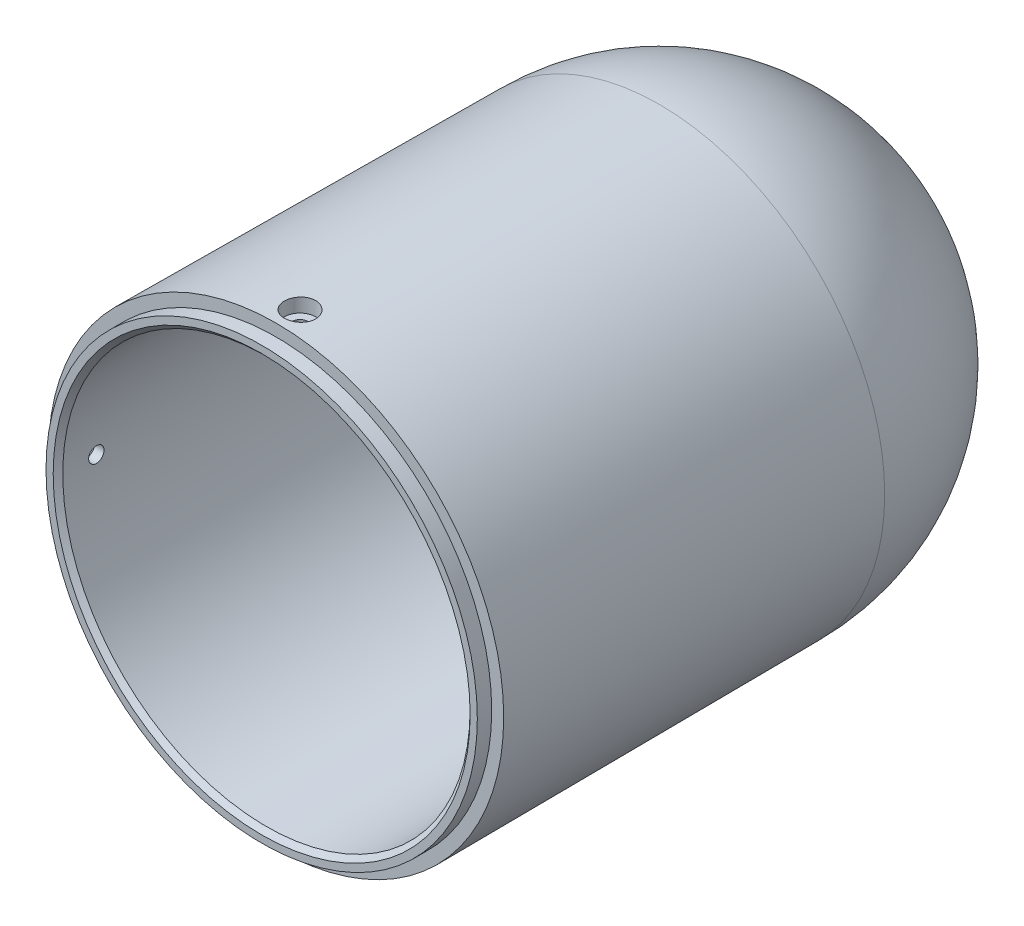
ISO-10303-21;
HEADER;
FILE_DESCRIPTION(('STEP AP214'),'2;1');
FILE_NAME('part.step','',(''),(''),'','','');
FILE_SCHEMA(('AUTOMOTIVE_DESIGN { 1 0 10303 214 1 1 1 1 }'));
ENDSEC;
DATA;
#1=APPLICATION_CONTEXT('core data for automotive mechanical design processes');
#2=APPLICATION_PROTOCOL_DEFINITION('international standard','automotive_design',2000,#1);
#3=PRODUCT_CONTEXT('',#1,'mechanical');
#4=PRODUCT('Part','Part','',(#3));
#5=PRODUCT_RELATED_PRODUCT_CATEGORY('part','',(#4));
#6=PRODUCT_DEFINITION_FORMATION('','',#4);
#7=PRODUCT_DEFINITION_CONTEXT('part definition',#1,'design');
#8=PRODUCT_DEFINITION('design','',#6,#7);
#9=PRODUCT_DEFINITION_SHAPE('','',#8);
#10=(LENGTH_UNIT() NAMED_UNIT(*) SI_UNIT(.MILLI.,.METRE.));
#11=(NAMED_UNIT(*) PLANE_ANGLE_UNIT() SI_UNIT($,.RADIAN.));
#12=(NAMED_UNIT(*) SI_UNIT($,.STERADIAN.) SOLID_ANGLE_UNIT());
#13=UNCERTAINTY_MEASURE_WITH_UNIT(LENGTH_MEASURE(1.E-05),#10,'distance_accuracy_value','');
#14=(GEOMETRIC_REPRESENTATION_CONTEXT(3) GLOBAL_UNCERTAINTY_ASSIGNED_CONTEXT((#13)) GLOBAL_UNIT_ASSIGNED_CONTEXT((#10,
#11,#12)) REPRESENTATION_CONTEXT('',''));
#15=CARTESIAN_POINT('',(0.,0.,0.));
#16=DIRECTION('',(0.,0.,1.));
#17=DIRECTION('',(1.,0.,0.));
#18=AXIS2_PLACEMENT_3D('',#15,#16,#17);
#19=CARTESIAN_POINT('',(0.,0.,0.));
#20=DIRECTION('',(0.,0.,1.));
#21=DIRECTION('',(1.,0.,0.));
#22=AXIS2_PLACEMENT_3D('',#19,#20,#21);
#23=PLANE('',#22);
#24=CARTESIAN_POINT('',(0.,0.,0.));
#25=DIRECTION('',(0.,0.,1.));
#26=DIRECTION('',(1.,0.,0.));
#27=AXIS2_PLACEMENT_3D('',#24,#25,#26);
#28=CIRCLE('',#27,47.5);
#29=CARTESIAN_POINT('',(47.5,0.,0.));
#30=VERTEX_POINT('',#29);
#31=EDGE_CURVE('E45',#30,#30,#28,.T.);
#32=ORIENTED_EDGE('',*,*,#31,.T.);
#33=EDGE_LOOP('',(#32));
#34=FACE_BOUND('',#33,.T.);
#35=CARTESIAN_POINT('',(0.,0.,0.));
#36=DIRECTION('',(0.,0.,1.));
#37=DIRECTION('',(1.,0.,0.));
#38=AXIS2_PLACEMENT_3D('',#35,#36,#37);
#39=CIRCLE('',#38,45.);
#40=CARTESIAN_POINT('',(45.,0.,0.));
#41=VERTEX_POINT('',#40);
#42=EDGE_CURVE('E308',#41,#41,#39,.T.);
#43=ORIENTED_EDGE('',*,*,#42,.F.);
#44=EDGE_LOOP('',(#43));
#45=FACE_BOUND('',#44,.T.);
#46=ADVANCED_FACE('F34',(#34,#45),#23,.T.);
#47=CARTESIAN_POINT('',(0.,0.,-80.));
#48=DIRECTION('',(0.,0.,1.));
#49=DIRECTION('',(1.,0.,0.));
#50=AXIS2_PLACEMENT_3D('',#47,#48,#49);
#51=CONICAL_SURFACE('',#50,47.,0.00624991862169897);
#52=CARTESIAN_POINT('',(-47.3980771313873,-2.31301205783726,-7.28308458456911));
#53=CARTESIAN_POINT('',(-47.3926354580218,-2.44117353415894,-7.15323195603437));
#54=CARTESIAN_POINT('',(-47.3872707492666,-2.55846675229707,-7.01247107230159));
#55=CARTESIAN_POINT('',(-47.3773761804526,-2.7678735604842,-6.71312941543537));
#56=CARTESIAN_POINT('',(-47.3728472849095,-2.85995811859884,-6.55452839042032));
#57=CARTESIAN_POINT('',(-47.3652268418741,-3.01618226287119,-6.2241357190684));
#58=CARTESIAN_POINT('',(-47.3621347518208,-3.08033239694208,-6.05234908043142));
#59=CARTESIAN_POINT('',(-47.3578277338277,-3.17887138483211,-5.7004680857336));
#60=CARTESIAN_POINT('',(-47.3566123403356,-3.21326761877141,-5.52037580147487));
#61=CARTESIAN_POINT('',(-47.3562903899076,-3.2513183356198,-5.15721441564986));
#62=CARTESIAN_POINT('',(-47.3571810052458,-3.25501400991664,-4.97414963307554));
#63=CARTESIAN_POINT('',(-47.3610607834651,-3.23167038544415,-4.61000718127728));
#64=CARTESIAN_POINT('',(-47.3640500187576,-3.20463002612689,-4.42892958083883));
#65=CARTESIAN_POINT('',(-47.3718818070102,-3.12062144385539,-4.07400867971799));
#66=CARTESIAN_POINT('',(-47.3767233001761,-3.06367032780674,-3.90016130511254));
#67=CARTESIAN_POINT('',(-47.3878051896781,-2.92148100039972,-3.56449580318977));
#68=CARTESIAN_POINT('',(-47.3940456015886,-2.83624247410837,-3.40267780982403));
#69=CARTESIAN_POINT('',(-47.4073219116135,-2.63970424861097,-3.09532167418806));
#70=CARTESIAN_POINT('',(-47.4143593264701,-2.52835441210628,-2.94981565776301));
#71=CARTESIAN_POINT('',(-47.4285048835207,-2.28282884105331,-2.67954186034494));
#72=CARTESIAN_POINT('',(-47.4356130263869,-2.14865288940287,-2.55477427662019));
#73=CARTESIAN_POINT('',(-47.449178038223,-1.86102239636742,-2.32931874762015));
#74=CARTESIAN_POINT('',(-47.4556338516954,-1.70753748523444,-2.22866947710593));
#75=CARTESIAN_POINT('',(-47.4672066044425,-1.38579760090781,-2.05457636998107));
#76=CARTESIAN_POINT('',(-47.4723235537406,-1.21754273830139,-1.9811323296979));
#77=CARTESIAN_POINT('',(-47.4806744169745,-0.8712593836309,-1.86363365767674));
#78=CARTESIAN_POINT('',(-47.4839107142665,-0.693243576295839,-1.81954181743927));
#79=CARTESIAN_POINT('',(-47.4881683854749,-0.33231118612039,-1.76187286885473));
#80=CARTESIAN_POINT('',(-47.4891897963,-0.149394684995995,-1.74829525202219));
#81=CARTESIAN_POINT('',(-47.4889099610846,0.215681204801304,-1.75204273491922));
#82=CARTESIAN_POINT('',(-47.4876142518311,0.3978413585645,-1.76929416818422));
#83=CARTESIAN_POINT('',(-47.4828476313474,0.756669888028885,-1.83405797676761));
#84=CARTESIAN_POINT('',(-47.4793767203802,0.933338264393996,-1.88157034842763));
#85=CARTESIAN_POINT('',(-47.4706245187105,1.27617991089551,-2.00549014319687));
#86=CARTESIAN_POINT('',(-47.465343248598,1.44235330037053,-2.08189723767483));
#87=CARTESIAN_POINT('',(-47.4535220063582,1.75952964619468,-2.2614301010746));
#88=CARTESIAN_POINT('',(-47.446982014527,1.91053236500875,-2.36455628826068));
#89=CARTESIAN_POINT('',(-47.4333047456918,2.19346624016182,-2.59488861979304));
#90=CARTESIAN_POINT('',(-47.4261660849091,2.32535117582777,-2.72215146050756));
#91=CARTESIAN_POINT('',(-47.4120403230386,2.56590469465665,-2.99700563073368));
#92=CARTESIAN_POINT('',(-47.4050532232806,2.6745730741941,-3.14459713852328));
#93=CARTESIAN_POINT('',(-47.3919309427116,2.86574313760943,-3.45615348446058));
#94=CARTESIAN_POINT('',(-47.3857968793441,2.94821067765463,-3.62013932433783));
#95=CARTESIAN_POINT('',(-47.3749992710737,3.08442743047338,-3.95967938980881));
#96=CARTESIAN_POINT('',(-47.3703357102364,3.1381769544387,-4.13523349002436));
#97=CARTESIAN_POINT('',(-47.3629216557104,3.21534651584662,-4.49263692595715));
#98=CARTESIAN_POINT('',(-47.3601681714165,3.2388140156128,-4.6744759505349));
#99=CARTESIAN_POINT('',(-47.3567790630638,3.25489127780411,-5.03953180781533));
#100=CARTESIAN_POINT('',(-47.3561434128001,3.24750142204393,-5.22274862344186));
#101=CARTESIAN_POINT('',(-47.3569645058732,3.20211642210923,-5.58498263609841));
#102=CARTESIAN_POINT('',(-47.3584171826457,3.16418082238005,-5.76400730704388));
#103=CARTESIAN_POINT('',(-47.3631490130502,3.0588638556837,-6.11314876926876));
#104=CARTESIAN_POINT('',(-47.3664281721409,2.9914824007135,-6.28326553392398));
#105=CARTESIAN_POINT('',(-47.3743557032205,2.82915033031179,-6.6098702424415));
#106=CARTESIAN_POINT('',(-47.3790048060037,2.73418500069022,-6.76635085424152));
#107=CARTESIAN_POINT('',(-47.3890658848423,2.51939110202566,-7.06117290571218));
#108=CARTESIAN_POINT('',(-47.3944778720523,2.39956216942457,-7.19951408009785));
#109=CARTESIAN_POINT('',(-47.4053948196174,2.13816753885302,-7.45440998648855));
#110=CARTESIAN_POINT('',(-47.4108999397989,1.9965601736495,-7.57092198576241));
#111=CARTESIAN_POINT('',(-47.4213116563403,1.69577974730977,-7.77852900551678));
#112=CARTESIAN_POINT('',(-47.4262182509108,1.53660663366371,-7.86962395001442));
#113=CARTESIAN_POINT('',(-47.4348335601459,1.20515272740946,-8.02382627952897));
#114=CARTESIAN_POINT('',(-47.4385419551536,1.0328684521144,-8.08692619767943));
#115=CARTESIAN_POINT('',(-47.4443073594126,0.680129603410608,-8.18329211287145));
#116=CARTESIAN_POINT('',(-47.4463644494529,0.499675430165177,-8.21655956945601));
#117=CARTESIAN_POINT('',(-47.4485758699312,0.136054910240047,-8.25227703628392));
#118=CARTESIAN_POINT('',(-47.4487335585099,-0.0471060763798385,-8.25478143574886));
#119=CARTESIAN_POINT('',(-47.4471354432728,-0.411291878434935,-8.2290346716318));
#120=CARTESIAN_POINT('',(-47.4453791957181,-0.592316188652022,-8.20077637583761));
#121=CARTESIAN_POINT('',(-47.4401666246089,-0.946969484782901,-8.11433246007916));
#122=CARTESIAN_POINT('',(-47.4367108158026,-1.12060069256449,-8.05615590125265));
#123=CARTESIAN_POINT('',(-47.4285202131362,-1.45548642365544,-7.9115719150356));
#124=CARTESIAN_POINT('',(-47.4237868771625,-1.61675478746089,-7.82519664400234));
#125=CARTESIAN_POINT('',(-47.41543961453,-1.86778943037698,-7.66225687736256));
#126=CARTESIAN_POINT('',(-47.4120294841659,-1.9625252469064,-7.5932021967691));
#127=CARTESIAN_POINT('',(-47.4050947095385,-2.14400404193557,-7.44529134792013));
#128=CARTESIAN_POINT('',(-47.4015700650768,-2.2307470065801,-7.36643516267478));
#129=CARTESIAN_POINT('',(-47.3980771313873,-2.31301205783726,-7.28308458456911));
#130=B_SPLINE_CURVE_WITH_KNOTS('',3,(#52,#53,#54,#55,#56,#57,#58,#59,#60,#61,#62,#63,#64,#65,
#66,#67,#68,#69,#70,#71,#72,#73,#74,#75,#76,#77,#78,#79,#80,#81,#82,#83,#84,#85,#86,#87,#88,#89,
#90,#91,#92,#93,#94,#95,#96,#97,#98,#99,#100,#101,#102,#103,#104,#105,#106,#107,#108,#109,#110,
#111,#112,#113,#114,#115,#116,#117,#118,#119,#120,#121,#122,#123,#124,#125,#126,#127,#128,#129),
.UNSPECIFIED.,.T.,.F.,(4,2,2,2,2,2,2,2,2,2,2,2,2,2,2,2,2,2,2,2,2,2,2,2,2,2,2,2,2,2,2,2,2,2,2,2,
2,2,4),(0.,0.547159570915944,1.09494666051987,1.64252672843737,2.18997093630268,
2.73668051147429,3.28340895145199,3.8298250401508,4.37624721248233,4.92372730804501,
5.47121261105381,6.01957004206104,6.56792336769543,7.11558023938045,7.66322798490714,
8.20956886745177,8.75590968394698,9.30224428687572,9.8485874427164,10.3962302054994,
10.943877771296,11.4922361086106,12.0405885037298,12.5880803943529,13.135565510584,
13.6819859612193,14.2284080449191,14.7751221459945,15.3218442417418,15.8696256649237,
16.41740872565,16.9653378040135,17.513240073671,18.0601735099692,18.6072337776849,
19.1541284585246,19.7004016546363,20.0516150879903,20.4028291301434),.UNSPECIFIED.);
#131=CARTESIAN_POINT('',(-47.3980771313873,-2.31301205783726,-7.28308458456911));
#132=VERTEX_POINT('',#131);
#133=EDGE_CURVE('E52',#132,#132,#130,.T.);
#134=ORIENTED_EDGE('',*,*,#133,.F.);
#135=EDGE_LOOP('',(#134));
#136=FACE_BOUND('',#135,.T.);
#137=CARTESIAN_POINT('',(-2.31301205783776,47.3980771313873,-7.28308458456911));
#138=CARTESIAN_POINT('',(-2.44117353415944,47.3926354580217,-7.15323195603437));
#139=CARTESIAN_POINT('',(-2.55846675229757,47.3872707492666,-7.01247107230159));
#140=CARTESIAN_POINT('',(-2.76787356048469,47.3773761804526,-6.71312941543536));
#141=CARTESIAN_POINT('',(-2.85995811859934,47.3728472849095,-6.55452839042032));
#142=CARTESIAN_POINT('',(-3.01618226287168,47.365226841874,-6.22413571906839));
#143=CARTESIAN_POINT('',(-3.08033239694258,47.3621347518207,-6.05234908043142));
#144=CARTESIAN_POINT('',(-3.17887138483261,47.3578277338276,-5.7004680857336));
#145=CARTESIAN_POINT('',(-3.21326761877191,47.3566123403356,-5.52037580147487));
#146=CARTESIAN_POINT('',(-3.2513183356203,47.3562903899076,-5.15721441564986));
#147=CARTESIAN_POINT('',(-3.25501400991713,47.3571810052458,-4.97414963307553));
#148=CARTESIAN_POINT('',(-3.23167038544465,47.361060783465,-4.61000718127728));
#149=CARTESIAN_POINT('',(-3.20463002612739,47.3640500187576,-4.42892958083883));
#150=CARTESIAN_POINT('',(-3.12062144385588,47.3718818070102,-4.07400867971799));
#151=CARTESIAN_POINT('',(-3.06367032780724,47.3767233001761,-3.90016130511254));
#152=CARTESIAN_POINT('',(-2.92148100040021,47.387805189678,-3.56449580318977));
#153=CARTESIAN_POINT('',(-2.83624247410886,47.3940456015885,-3.40267780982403));
#154=CARTESIAN_POINT('',(-2.63970424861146,47.4073219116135,-3.09532167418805));
#155=CARTESIAN_POINT('',(-2.52835441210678,47.41435932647,-2.94981565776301));
#156=CARTESIAN_POINT('',(-2.28282884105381,47.4285048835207,-2.67954186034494));
#157=CARTESIAN_POINT('',(-2.14865288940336,47.4356130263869,-2.55477427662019));
#158=CARTESIAN_POINT('',(-1.86102239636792,47.449178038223,-2.32931874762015));
#159=CARTESIAN_POINT('',(-1.70753748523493,47.4556338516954,-2.22866947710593));
#160=CARTESIAN_POINT('',(-1.3857976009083,47.4672066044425,-2.05457636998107));
#161=CARTESIAN_POINT('',(-1.21754273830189,47.4723235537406,-1.9811323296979));
#162=CARTESIAN_POINT('',(-0.871259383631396,47.4806744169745,-1.86363365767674));
#163=CARTESIAN_POINT('',(-0.693243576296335,47.4839107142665,-1.81954181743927));
#164=CARTESIAN_POINT('',(-0.332311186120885,47.4881683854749,-1.76187286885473));
#165=CARTESIAN_POINT('',(-0.14939468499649,47.4891897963,-1.74829525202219));
#166=CARTESIAN_POINT('',(0.21568120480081,47.4889099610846,-1.75204273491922));
#167=CARTESIAN_POINT('',(0.397841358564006,47.4876142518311,-1.76929416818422));
#168=CARTESIAN_POINT('',(0.756669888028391,47.4828476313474,-1.83405797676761));
#169=CARTESIAN_POINT('',(0.933338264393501,47.4793767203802,-1.88157034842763));
#170=CARTESIAN_POINT('',(1.27617991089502,47.4706245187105,-2.00549014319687));
#171=CARTESIAN_POINT('',(1.44235330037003,47.4653432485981,-2.08189723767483));
#172=CARTESIAN_POINT('',(1.75952964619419,47.4535220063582,-2.2614301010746));
#173=CARTESIAN_POINT('',(1.91053236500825,47.446982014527,-2.36455628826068));
#174=CARTESIAN_POINT('',(2.19346624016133,47.4333047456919,-2.59488861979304));
#175=CARTESIAN_POINT('',(2.32535117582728,47.4261660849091,-2.72215146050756));
#176=CARTESIAN_POINT('',(2.56590469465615,47.4120403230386,-2.99700563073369));
#177=CARTESIAN_POINT('',(2.6745730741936,47.4050532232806,-3.14459713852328));
#178=CARTESIAN_POINT('',(2.86574313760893,47.3919309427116,-3.45615348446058));
#179=CARTESIAN_POINT('',(2.94821067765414,47.3857968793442,-3.62013932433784));
#180=CARTESIAN_POINT('',(3.08442743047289,47.3749992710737,-3.95967938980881));
#181=CARTESIAN_POINT('',(3.1381769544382,47.3703357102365,-4.13523349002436));
#182=CARTESIAN_POINT('',(3.21534651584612,47.3629216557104,-4.49263692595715));
#183=CARTESIAN_POINT('',(3.2388140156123,47.3601681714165,-4.67447595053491));
#184=CARTESIAN_POINT('',(3.25489127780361,47.3567790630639,-5.03953180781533));
#185=CARTESIAN_POINT('',(3.24750142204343,47.3561434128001,-5.22274862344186));
#186=CARTESIAN_POINT('',(3.20211642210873,47.3569645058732,-5.58498263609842));
#187=CARTESIAN_POINT('',(3.16418082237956,47.3584171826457,-5.76400730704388));
#188=CARTESIAN_POINT('',(3.0588638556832,47.3631490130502,-6.11314876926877));
#189=CARTESIAN_POINT('',(2.991482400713,47.366428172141,-6.28326553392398));
#190=CARTESIAN_POINT('',(2.82915033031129,47.3743557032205,-6.6098702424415));
#191=CARTESIAN_POINT('',(2.73418500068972,47.3790048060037,-6.76635085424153));
#192=CARTESIAN_POINT('',(2.51939110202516,47.3890658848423,-7.06117290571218));
#193=CARTESIAN_POINT('',(2.39956216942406,47.3944778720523,-7.19951408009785));
#194=CARTESIAN_POINT('',(2.13816753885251,47.4053948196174,-7.45440998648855));
#195=CARTESIAN_POINT('',(1.996560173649,47.4108999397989,-7.57092198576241));
#196=CARTESIAN_POINT('',(1.69577974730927,47.4213116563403,-7.77852900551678));
#197=CARTESIAN_POINT('',(1.53660663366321,47.4262182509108,-7.86962395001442));
#198=CARTESIAN_POINT('',(1.20515272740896,47.4348335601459,-8.02382627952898));
#199=CARTESIAN_POINT('',(1.03286845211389,47.4385419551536,-8.08692619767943));
#200=CARTESIAN_POINT('',(0.680129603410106,47.4443073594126,-8.18329211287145));
#201=CARTESIAN_POINT('',(0.499675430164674,47.4463644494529,-8.21655956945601));
#202=CARTESIAN_POINT('',(0.136054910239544,47.4485758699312,-8.25227703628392));
#203=CARTESIAN_POINT('',(-0.0471060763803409,47.4487335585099,-8.25478143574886));
#204=CARTESIAN_POINT('',(-0.411291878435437,47.4471354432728,-8.2290346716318));
#205=CARTESIAN_POINT('',(-0.592316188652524,47.4453791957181,-8.20077637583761));
#206=CARTESIAN_POINT('',(-0.946969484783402,47.4401666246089,-8.11433246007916));
#207=CARTESIAN_POINT('',(-1.12060069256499,47.4367108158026,-8.05615590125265));
#208=CARTESIAN_POINT('',(-1.45548642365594,47.4285202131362,-7.9115719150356));
#209=CARTESIAN_POINT('',(-1.61675478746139,47.4237868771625,-7.82519664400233));
#210=CARTESIAN_POINT('',(-1.86778943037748,47.41543961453,-7.66225687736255));
#211=CARTESIAN_POINT('',(-1.9625252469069,47.4120294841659,-7.59320219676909));
#212=CARTESIAN_POINT('',(-2.14400404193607,47.4050947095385,-7.44529134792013));
#213=CARTESIAN_POINT('',(-2.2307470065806,47.4015700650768,-7.36643516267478));
#214=CARTESIAN_POINT('',(-2.31301205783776,47.3980771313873,-7.28308458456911));
#215=B_SPLINE_CURVE_WITH_KNOTS('',3,(#137,#138,#139,#140,#141,#142,#143,#144,#145,#146,#147,
#148,#149,#150,#151,#152,#153,#154,#155,#156,#157,#158,#159,#160,#161,#162,#163,#164,#165,#166,
#167,#168,#169,#170,#171,#172,#173,#174,#175,#176,#177,#178,#179,#180,#181,#182,#183,#184,#185,
#186,#187,#188,#189,#190,#191,#192,#193,#194,#195,#196,#197,#198,#199,#200,#201,#202,#203,#204,
#205,#206,#207,#208,#209,#210,#211,#212,#213,#214),.UNSPECIFIED.,.T.,.F.,(4,2,2,2,2,2,2,2,2,2,2,
2,2,2,2,2,2,2,2,2,2,2,2,2,2,2,2,2,2,2,2,2,2,2,2,2,2,2,4),(0.,0.547159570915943,1.09494666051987,
1.64252672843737,2.18997093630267,2.73668051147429,3.28340895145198,3.8298250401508,
4.37624721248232,4.92372730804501,5.47121261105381,6.01957004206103,6.56792336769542,
7.11558023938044,7.66322798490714,8.20956886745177,8.75590968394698,9.30224428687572,
9.8485874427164,10.3962302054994,10.943877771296,11.4922361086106,12.0405885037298,
12.5880803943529,13.135565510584,13.6819859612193,14.2284080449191,14.7751221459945,
15.3218442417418,15.8696256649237,16.41740872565,16.9653378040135,17.513240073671,
18.0601735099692,18.6072337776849,19.1541284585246,19.7004016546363,20.0516150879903,
20.4028291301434),.UNSPECIFIED.);
#216=CARTESIAN_POINT('',(-2.31301205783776,47.3980771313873,-7.28308458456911));
#217=VERTEX_POINT('',#216);
#218=EDGE_CURVE('E60',#217,#217,#215,.T.);
#219=ORIENTED_EDGE('',*,*,#218,.F.);
#220=EDGE_LOOP('',(#219));
#221=FACE_BOUND('',#220,.T.);
#222=ORIENTED_EDGE('',*,*,#31,.F.);
#223=EDGE_LOOP('',(#222));
#224=FACE_BOUND('',#223,.T.);
#225=CARTESIAN_POINT('',(0.,0.,-80.));
#226=DIRECTION('',(0.,0.,1.));
#227=DIRECTION('',(1.,0.,0.));
#228=AXIS2_PLACEMENT_3D('',#225,#226,#227);
#229=CIRCLE('',#228,47.);
#230=CARTESIAN_POINT('',(47.,0.,-80.));
#231=VERTEX_POINT('',#230);
#232=EDGE_CURVE('E156',#231,#231,#229,.T.);
#233=ORIENTED_EDGE('',*,*,#232,.T.);
#234=EDGE_LOOP('',(#233));
#235=FACE_BOUND('',#234,.T.);
#236=ADVANCED_FACE('F65',(#136,#221,#224,#235),#51,.T.);
#237=CARTESIAN_POINT('',(0.,0.,0.000100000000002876));
#238=DIRECTION('',(0.,0.,-1.));
#239=DIRECTION('',(-1.,0.,0.));
#240=AXIS2_PLACEMENT_3D('',#237,#238,#239);
#241=CYLINDRICAL_SURFACE('',#240,42.5);
#242=CARTESIAN_POINT('',(0.,0.,1.99999999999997));
#243=DIRECTION('',(0.,0.,1.));
#244=DIRECTION('',(1.,0.,0.));
#245=AXIS2_PLACEMENT_3D('',#242,#243,#244);
#246=CIRCLE('',#245,42.5);
#247=CARTESIAN_POINT('',(42.5,0.,1.99999999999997));
#248=VERTEX_POINT('',#247);
#249=EDGE_CURVE('E41',#248,#248,#246,.T.);
#250=ORIENTED_EDGE('',*,*,#249,.T.);
#251=EDGE_LOOP('',(#250));
#252=FACE_BOUND('',#251,.T.);
#253=CARTESIAN_POINT('',(-42.5,0.,-3.4));
#254=CARTESIAN_POINT('',(-42.4999995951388,-0.0898385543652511,-3.40000397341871));
#255=CARTESIAN_POINT('',(-42.4997120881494,-0.179741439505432,-3.4075919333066));
#256=CARTESIAN_POINT('',(-42.4985928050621,-0.35706889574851,-3.43775520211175));
#257=CARTESIAN_POINT('',(-42.4977603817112,-0.444490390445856,-3.46034833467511));
#258=CARTESIAN_POINT('',(-42.4956455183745,-0.614260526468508,-3.51987576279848));
#259=CARTESIAN_POINT('',(-42.4943633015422,-0.696611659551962,-3.55680294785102));
#260=CARTESIAN_POINT('',(-42.4914934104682,-0.853923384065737,-3.64393981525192));
#261=CARTESIAN_POINT('',(-42.4899058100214,-0.928885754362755,-3.69414628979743));
#262=CARTESIAN_POINT('',(-42.4866027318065,-1.06936249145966,-3.80645299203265));
#263=CARTESIAN_POINT('',(-42.4848871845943,-1.13487167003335,-3.86855970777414));
#264=CARTESIAN_POINT('',(-42.4815221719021,-1.25453852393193,-4.00289174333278));
#265=CARTESIAN_POINT('',(-42.4798727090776,-1.3086957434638,-4.07511746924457));
#266=CARTESIAN_POINT('',(-42.4768254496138,-1.40413266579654,-4.22766067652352));
#267=CARTESIAN_POINT('',(-42.4754277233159,-1.44540877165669,-4.30798040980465));
#268=CARTESIAN_POINT('',(-42.4730422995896,-1.51388857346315,-4.47441570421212));
#269=CARTESIAN_POINT('',(-42.4720546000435,-1.54109234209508,-4.56053123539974));
#270=CARTESIAN_POINT('',(-42.470601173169,-1.58064278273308,-4.73607000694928));
#271=CARTESIAN_POINT('',(-42.4701351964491,-1.59299655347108,-4.82549164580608));
#272=CARTESIAN_POINT('',(-42.4697770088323,-1.60251820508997,-5.00514062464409));
#273=CARTESIAN_POINT('',(-42.469884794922,-1.59968616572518,-5.09536796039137));
#274=CARTESIAN_POINT('',(-42.470661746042,-1.5789225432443,-5.27401893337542));
#275=CARTESIAN_POINT('',(-42.4713306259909,-1.56099862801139,-5.36244346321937));
#276=CARTESIAN_POINT('',(-42.4731539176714,-1.51057191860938,-5.53502763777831));
#277=CARTESIAN_POINT('',(-42.4743083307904,-1.4780690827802,-5.61918727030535));
#278=CARTESIAN_POINT('',(-42.4769728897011,-1.39939837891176,-5.78087737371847));
#279=CARTESIAN_POINT('',(-42.4784831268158,-1.35322700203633,-5.85840613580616));
#280=CARTESIAN_POINT('',(-42.4816890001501,-1.24853243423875,-6.00461502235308));
#281=CARTESIAN_POINT('',(-42.4833846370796,-1.19000919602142,-6.07329511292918));
#282=CARTESIAN_POINT('',(-42.4867714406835,-1.06222882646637,-6.19990173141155));
#283=CARTESIAN_POINT('',(-42.4884626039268,-0.992965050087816,-6.25782155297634));
#284=CARTESIAN_POINT('',(-42.4916488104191,-0.845693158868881,-6.36121185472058));
#285=CARTESIAN_POINT('',(-42.4931438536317,-0.76768504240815,-6.40668233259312));
#286=CARTESIAN_POINT('',(-42.4957693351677,-0.605135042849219,-6.48388249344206));
#287=CARTESIAN_POINT('',(-42.4968997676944,-0.520593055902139,-6.5156119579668));
#288=CARTESIAN_POINT('',(-42.498668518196,-0.347376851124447,-6.56442509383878));
#289=CARTESIAN_POINT('',(-42.4993068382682,-0.258702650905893,-6.58150882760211));
#290=CARTESIAN_POINT('',(-42.5000191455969,-0.0797974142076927,-6.60053732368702));
#291=CARTESIAN_POINT('',(-42.5000934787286,0.0104326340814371,-6.60249136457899));
#292=CARTESIAN_POINT('',(-42.4996703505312,0.189939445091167,-6.59122919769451));
#293=CARTESIAN_POINT('',(-42.4991728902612,0.279216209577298,-6.57801301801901));
#294=CARTESIAN_POINT('',(-42.4976624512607,0.454256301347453,-6.53679324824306));
#295=CARTESIAN_POINT('',(-42.4966496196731,0.540020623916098,-6.5087938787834));
#296=CARTESIAN_POINT('',(-42.4942225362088,0.705631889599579,-6.43880680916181));
#297=CARTESIAN_POINT('',(-42.4928082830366,0.785478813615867,-6.39681906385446));
#298=CARTESIAN_POINT('',(-42.4897367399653,0.937031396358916,-6.30002327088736));
#299=CARTESIAN_POINT('',(-42.488079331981,1.00873306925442,-6.24520898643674));
#300=CARTESIAN_POINT('',(-42.4847086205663,1.14191975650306,-6.12432523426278));
#301=CARTESIAN_POINT('',(-42.4829953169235,1.20340473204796,-6.05825572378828));
#302=CARTESIAN_POINT('',(-42.4797049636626,1.3144437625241,-5.916697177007));
#303=CARTESIAN_POINT('',(-42.4781279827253,1.36399182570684,-5.84120343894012));
#304=CARTESIAN_POINT('',(-42.4752891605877,1.44970959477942,-5.68296332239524));
#305=CARTESIAN_POINT('',(-42.4740273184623,1.48587933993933,-5.60021696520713));
#306=CARTESIAN_POINT('',(-42.4719615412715,1.54380325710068,-5.42984291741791));
#307=CARTESIAN_POINT('',(-42.4711574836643,1.56556128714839,-5.34221654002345));
#308=CARTESIAN_POINT('',(-42.4700975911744,1.59405677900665,-5.16455133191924));
#309=CARTESIAN_POINT('',(-42.469841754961,1.60079427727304,-5.0745125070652));
#310=CARTESIAN_POINT('',(-42.46990719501,1.59905701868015,-4.89463807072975));
#311=CARTESIAN_POINT('',(-42.470228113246,1.59059169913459,-4.804802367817));
#312=CARTESIAN_POINT('',(-42.4714101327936,1.55870855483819,-4.62782834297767));
#313=CARTESIAN_POINT('',(-42.4722712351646,1.53529070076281,-4.54069002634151));
#314=CARTESIAN_POINT('',(-42.4744364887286,1.47416886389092,-4.37158154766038));
#315=CARTESIAN_POINT('',(-42.4757406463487,1.43646467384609,-4.28961146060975));
#316=CARTESIAN_POINT('',(-42.4786449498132,1.34784277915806,-4.13316566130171));
#317=CARTESIAN_POINT('',(-42.4802450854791,1.29692552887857,-4.05868969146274));
#318=CARTESIAN_POINT('',(-42.483562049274,1.18329163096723,-3.91930070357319));
#319=CARTESIAN_POINT('',(-42.4852789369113,1.12056893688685,-3.85439261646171));
#320=CARTESIAN_POINT('',(-42.4886356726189,0.985098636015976,-3.73600906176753));
#321=CARTESIAN_POINT('',(-42.490275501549,0.912348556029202,-3.68253642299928));
#322=CARTESIAN_POINT('',(-42.4932940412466,0.758850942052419,-3.58852747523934));
#323=CARTESIAN_POINT('',(-42.4946725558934,0.678097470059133,-3.54800086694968));
#324=CARTESIAN_POINT('',(-42.4970098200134,0.510989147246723,-3.48112837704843));
#325=CARTESIAN_POINT('',(-42.4979690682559,0.424641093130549,-3.45476563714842));
#326=CARTESIAN_POINT('',(-42.4991041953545,0.281458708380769,-3.42393256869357));
#327=CARTESIAN_POINT('',(-42.4994386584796,0.225553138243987,-3.41496920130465));
#328=CARTESIAN_POINT('',(-42.4998866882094,0.113106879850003,-3.40300166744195));
#329=CARTESIAN_POINT('',(-42.5000002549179,0.0565661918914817,-3.39999749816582));
#330=CARTESIAN_POINT('',(-42.5,0.,-3.4));
#331=B_SPLINE_CURVE_WITH_KNOTS('',3,(#253,#254,#255,#256,#257,#258,#259,#260,#261,#262,#263,
#264,#265,#266,#267,#268,#269,#270,#271,#272,#273,#274,#275,#276,#277,#278,#279,#280,#281,#282,
#283,#284,#285,#286,#287,#288,#289,#290,#291,#292,#293,#294,#295,#296,#297,#298,#299,#300,#301,
#302,#303,#304,#305,#306,#307,#308,#309,#310,#311,#312,#313,#314,#315,#316,#317,#318,#319,#320,
#321,#322,#323,#324,#325,#326,#327,#328,#329,#330),.UNSPECIFIED.,.T.,.F.,(4,2,2,2,2,2,2,2,2,2,2,
2,2,2,2,2,2,2,2,2,2,2,2,2,2,2,2,2,2,2,2,2,2,2,2,2,2,2,4),(0.,0.269309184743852,
0.538938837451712,0.808434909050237,1.07786593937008,1.34744428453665,1.61703345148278,
1.8866978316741,2.1563608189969,2.42589484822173,2.69542746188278,2.96482321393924,
3.23421973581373,3.50368547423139,3.77315224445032,4.04278640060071,4.31242060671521,
4.58205909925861,4.851696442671,5.12116841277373,5.39063988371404,5.66003446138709,
5.92942990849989,6.19895661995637,6.46848435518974,6.7381470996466,7.00780905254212,
7.27739878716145,7.54698786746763,7.81640965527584,8.08583197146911,8.35525819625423,
8.62467515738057,8.89423048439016,9.16385241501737,9.43367590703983,9.70317753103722,
9.87274617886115,10.0423147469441),.UNSPECIFIED.);
#332=CARTESIAN_POINT('',(-42.5,0.,-3.4));
#333=VERTEX_POINT('',#332);
#334=EDGE_CURVE('E59',#333,#333,#331,.T.);
#335=ORIENTED_EDGE('',*,*,#334,.F.);
#336=EDGE_LOOP('',(#335));
#337=FACE_BOUND('',#336,.T.);
#338=CARTESIAN_POINT('',(0.,42.5,-3.4));
#339=CARTESIAN_POINT('',(-0.0898385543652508,42.4999995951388,-3.40000397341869));
#340=CARTESIAN_POINT('',(-0.179741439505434,42.4997120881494,-3.40759193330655));
#341=CARTESIAN_POINT('',(-0.357068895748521,42.4985928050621,-3.43775520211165));
#342=CARTESIAN_POINT('',(-0.444490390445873,42.4977603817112,-3.46034833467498));
#343=CARTESIAN_POINT('',(-0.614260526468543,42.4956455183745,-3.5198757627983));
#344=CARTESIAN_POINT('',(-0.696611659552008,42.4943633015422,-3.55680294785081));
#345=CARTESIAN_POINT('',(-0.853923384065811,42.4914934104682,-3.64393981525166));
#346=CARTESIAN_POINT('',(-0.928885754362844,42.4899058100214,-3.69414628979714));
#347=CARTESIAN_POINT('',(-1.06936249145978,42.4866027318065,-3.80645299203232));
#348=CARTESIAN_POINT('',(-1.1348716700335,42.4848871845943,-3.8685597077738));
#349=CARTESIAN_POINT('',(-1.25453852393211,42.4815221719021,-4.0028917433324));
#350=CARTESIAN_POINT('',(-1.308695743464,42.4798727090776,-4.07511746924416));
#351=CARTESIAN_POINT('',(-1.40413266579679,42.4768254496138,-4.22766067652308));
#352=CARTESIAN_POINT('',(-1.44540877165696,42.4754277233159,-4.3079804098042));
#353=CARTESIAN_POINT('',(-1.51388857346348,42.4730422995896,-4.47441570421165));
#354=CARTESIAN_POINT('',(-1.54109234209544,42.4720546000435,-4.56053123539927));
#355=CARTESIAN_POINT('',(-1.58064278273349,42.470601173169,-4.73607000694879));
#356=CARTESIAN_POINT('',(-1.59299655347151,42.4701351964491,-4.82549164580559));
#357=CARTESIAN_POINT('',(-1.60251820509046,42.4697770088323,-5.00514062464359));
#358=CARTESIAN_POINT('',(-1.5996861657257,42.469884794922,-5.09536796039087));
#359=CARTESIAN_POINT('',(-1.57892254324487,42.4706617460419,-5.27401893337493));
#360=CARTESIAN_POINT('',(-1.560998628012,42.4713306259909,-5.36244346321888));
#361=CARTESIAN_POINT('',(-1.51057191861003,42.4731539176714,-5.53502763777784));
#362=CARTESIAN_POINT('',(-1.47806908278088,42.4743083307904,-5.61918727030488));
#363=CARTESIAN_POINT('',(-1.3993983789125,42.4769728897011,-5.78087737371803));
#364=CARTESIAN_POINT('',(-1.35322700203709,42.4784831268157,-5.85840613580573));
#365=CARTESIAN_POINT('',(-1.24853243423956,42.4816890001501,-6.00461502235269));
#366=CARTESIAN_POINT('',(-1.19000919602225,42.4833846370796,-6.07329511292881));
#367=CARTESIAN_POINT('',(-1.06222882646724,42.4867714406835,-6.19990173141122));
#368=CARTESIAN_POINT('',(-0.992965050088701,42.4884626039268,-6.25782155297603));
#369=CARTESIAN_POINT('',(-0.8456931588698,42.491648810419,-6.36121185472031));
#370=CARTESIAN_POINT('',(-0.767685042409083,42.4931438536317,-6.40668233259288));
#371=CARTESIAN_POINT('',(-0.605135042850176,42.4957693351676,-6.48388249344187));
#372=CARTESIAN_POINT('',(-0.520593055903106,42.4968997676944,-6.51561195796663));
#373=CARTESIAN_POINT('',(-0.34737685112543,42.498668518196,-6.56442509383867));
#374=CARTESIAN_POINT('',(-0.258702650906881,42.4993068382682,-6.58150882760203));
#375=CARTESIAN_POINT('',(-0.0797974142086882,42.5000191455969,-6.60053732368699));
#376=CARTESIAN_POINT('',(0.0104326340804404,42.5000934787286,-6.60249136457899));
#377=CARTESIAN_POINT('',(0.189939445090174,42.4996703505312,-6.59122919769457));
#378=CARTESIAN_POINT('',(0.279216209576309,42.4991728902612,-6.57801301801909));
#379=CARTESIAN_POINT('',(0.454256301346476,42.4976624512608,-6.5367932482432));
#380=CARTESIAN_POINT('',(0.540020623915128,42.4966496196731,-6.50879387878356));
#381=CARTESIAN_POINT('',(0.705631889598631,42.4942225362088,-6.43880680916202));
#382=CARTESIAN_POINT('',(0.785478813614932,42.4928082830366,-6.39681906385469));
#383=CARTESIAN_POINT('',(0.937031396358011,42.4897367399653,-6.30002327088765));
#384=CARTESIAN_POINT('',(1.00873306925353,42.488079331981,-6.24520898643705));
#385=CARTESIAN_POINT('',(1.14191975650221,42.4847086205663,-6.12432523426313));
#386=CARTESIAN_POINT('',(1.20340473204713,42.4829953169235,-6.05825572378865));
#387=CARTESIAN_POINT('',(1.31444376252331,42.4797049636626,-5.91669717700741));
#388=CARTESIAN_POINT('',(1.36399182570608,42.4781279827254,-5.84120343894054));
#389=CARTESIAN_POINT('',(1.4497095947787,42.4752891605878,-5.68296332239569));
#390=CARTESIAN_POINT('',(1.48587933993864,42.4740273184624,-5.60021696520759));
#391=CARTESIAN_POINT('',(1.54380325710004,42.4719615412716,-5.42984291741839));
#392=CARTESIAN_POINT('',(1.56556128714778,42.4711574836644,-5.34221654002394));
#393=CARTESIAN_POINT('',(1.5940567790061,42.4700975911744,-5.16455133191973));
#394=CARTESIAN_POINT('',(1.60079427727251,42.469841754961,-5.07451250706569));
#395=CARTESIAN_POINT('',(1.59905701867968,42.4699071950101,-4.89463807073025));
#396=CARTESIAN_POINT('',(1.59059169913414,42.470228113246,-4.80480236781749));
#397=CARTESIAN_POINT('',(1.5587085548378,42.4714101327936,-4.62782834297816));
#398=CARTESIAN_POINT('',(1.53529070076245,42.4722712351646,-4.54069002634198));
#399=CARTESIAN_POINT('',(1.47416886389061,42.4744364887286,-4.37158154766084));
#400=CARTESIAN_POINT('',(1.43646467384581,42.4757406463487,-4.2896114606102));
#401=CARTESIAN_POINT('',(1.34784277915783,42.4786449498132,-4.13316566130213));
#402=CARTESIAN_POINT('',(1.29692552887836,42.4802450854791,-4.05868969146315));
#403=CARTESIAN_POINT('',(1.18329163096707,42.483562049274,-3.91930070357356));
#404=CARTESIAN_POINT('',(1.12056893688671,42.4852789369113,-3.85439261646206));
#405=CARTESIAN_POINT('',(0.985098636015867,42.4886356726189,-3.73600906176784));
#406=CARTESIAN_POINT('',(0.91234855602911,42.490275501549,-3.68253642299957));
#407=CARTESIAN_POINT('',(0.758850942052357,42.4932940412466,-3.58852747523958));
#408=CARTESIAN_POINT('',(0.678097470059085,42.4946725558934,-3.54800086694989));
#409=CARTESIAN_POINT('',(0.510989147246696,42.4970098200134,-3.48112837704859));
#410=CARTESIAN_POINT('',(0.424641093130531,42.4979690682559,-3.45476563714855));
#411=CARTESIAN_POINT('',(0.28145870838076,42.4991041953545,-3.42393256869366));
#412=CARTESIAN_POINT('',(0.225553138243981,42.4994386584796,-3.41496920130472));
#413=CARTESIAN_POINT('',(0.113106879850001,42.4998866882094,-3.40300166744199));
#414=CARTESIAN_POINT('',(0.0565661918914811,42.5000002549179,-3.39999749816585));
#415=CARTESIAN_POINT('',(0.,42.5,-3.4));
#416=B_SPLINE_CURVE_WITH_KNOTS('',3,(#338,#339,#340,#341,#342,#343,#344,#345,#346,#347,#348,
#349,#350,#351,#352,#353,#354,#355,#356,#357,#358,#359,#360,#361,#362,#363,#364,#365,#366,#367,
#368,#369,#370,#371,#372,#373,#374,#375,#376,#377,#378,#379,#380,#381,#382,#383,#384,#385,#386,
#387,#388,#389,#390,#391,#392,#393,#394,#395,#396,#397,#398,#399,#400,#401,#402,#403,#404,#405,
#406,#407,#408,#409,#410,#411,#412,#413,#414,#415),.UNSPECIFIED.,.T.,.F.,(4,2,2,2,2,2,2,2,2,2,2,
2,2,2,2,2,2,2,2,2,2,2,2,2,2,2,2,2,2,2,2,2,2,2,2,2,2,2,4),(0.,0.269309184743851,0.53893883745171,
0.808434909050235,1.07786593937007,1.34744428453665,1.61703345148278,1.8866978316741,
2.15636081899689,2.42589484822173,2.69542746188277,2.96482321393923,3.23421973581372,
3.50368547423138,3.77315224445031,4.04278640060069,4.3124206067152,4.5820590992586,
4.85169644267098,5.12116841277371,5.39063988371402,5.66003446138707,5.92942990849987,
6.19895661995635,6.46848435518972,6.73814709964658,7.00780905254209,7.27739878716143,
7.5469878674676,7.81640965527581,8.08583197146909,8.3552581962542,8.62467515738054,
8.89423048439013,9.16385241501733,9.4336759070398,9.70317753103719,9.87274617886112,
10.0423147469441),.UNSPECIFIED.);
#417=CARTESIAN_POINT('',(0.,42.5,-3.4));
#418=VERTEX_POINT('',#417);
#419=EDGE_CURVE('E101',#418,#418,#416,.T.);
#420=ORIENTED_EDGE('',*,*,#419,.F.);
#421=EDGE_LOOP('',(#420));
#422=FACE_BOUND('',#421,.T.);
#423=CARTESIAN_POINT('',(0.,0.,-80.));
#424=DIRECTION('',(0.,0.,1.));
#425=DIRECTION('',(1.,0.,0.));
#426=AXIS2_PLACEMENT_3D('',#423,#424,#425);
#427=CIRCLE('',#426,42.5);
#428=CARTESIAN_POINT('',(42.5,0.,-80.));
#429=VERTEX_POINT('',#428);
#430=EDGE_CURVE('E49',#429,#429,#427,.T.);
#431=ORIENTED_EDGE('',*,*,#430,.F.);
#432=EDGE_LOOP('',(#431));
#433=FACE_BOUND('',#432,.T.);
#434=ADVANCED_FACE('F133',(#252,#337,#422,#433),#241,.F.);
#435=CARTESIAN_POINT('',(0.,47.,-80.));
#436=DIRECTION('',(0.,0.,-1.));
#437=DIRECTION('',(-1.,0.,0.));
#438=AXIS2_PLACEMENT_3D('',#435,#436,#437);
#439=PLANE('',#438);
#440=ORIENTED_EDGE('',*,*,#430,.T.);
#441=EDGE_LOOP('',(#440));
#442=FACE_BOUND('',#441,.T.);
#443=CARTESIAN_POINT('',(0.,0.,-80.));
#444=DIRECTION('',(0.,0.,1.));
#445=DIRECTION('',(1.,0.,0.));
#446=AXIS2_PLACEMENT_3D('',#443,#444,#445);
#447=CIRCLE('',#446,42.);
#448=CARTESIAN_POINT('',(42.,0.,-80.));
#449=VERTEX_POINT('',#448);
#450=EDGE_CURVE('E108',#449,#449,#447,.T.);
#451=ORIENTED_EDGE('',*,*,#450,.F.);
#452=EDGE_LOOP('',(#451));
#453=FACE_BOUND('',#452,.T.);
#454=ADVANCED_FACE('F170',(#442,#453),#439,.F.);
#455=CARTESIAN_POINT('',(0.,0.,-80.));
#456=DIRECTION('',(0.,0.,1.));
#457=DIRECTION('',(0.,1.,0.));
#458=AXIS2_PLACEMENT_3D('',#455,#456,#457);
#459=SPHERICAL_SURFACE('',#458,42.);
#460=ORIENTED_EDGE('',*,*,#450,.T.);
#461=EDGE_LOOP('',(#460));
#462=FACE_BOUND('',#461,.T.);
#463=ADVANCED_FACE('F168',(#462),#459,.F.);
#464=CARTESIAN_POINT('',(0.,0.,-80.));
#465=DIRECTION('',(0.,0.,1.));
#466=DIRECTION('',(0.,1.,0.));
#467=AXIS2_PLACEMENT_3D('',#464,#465,#466);
#468=SPHERICAL_SURFACE('',#467,47.);
#469=ORIENTED_EDGE('',*,*,#232,.F.);
#470=EDGE_LOOP('',(#469));
#471=FACE_BOUND('',#470,.T.);
#472=ADVANCED_FACE('F117',(#471),#468,.T.);
#473=CARTESIAN_POINT('',(0.,47.5,-5.));
#474=DIRECTION('',(0.,1.,0.));
#475=DIRECTION('',(0.,0.,1.));
#476=AXIS2_PLACEMENT_3D('',#473,#474,#475);
#477=CYLINDRICAL_SURFACE('',#476,1.6);
#478=CARTESIAN_POINT('',(0.,44.5,-5.));
#479=DIRECTION('',(0.,1.,0.));
#480=DIRECTION('',(0.,0.,1.));
#481=AXIS2_PLACEMENT_3D('',#478,#479,#480);
#482=CIRCLE('',#481,1.60000000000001);
#483=CARTESIAN_POINT('',(0.,44.5,-3.39999999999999));
#484=VERTEX_POINT('',#483);
#485=EDGE_CURVE('E98',#484,#484,#482,.T.);
#486=ORIENTED_EDGE('',*,*,#485,.T.);
#487=EDGE_LOOP('',(#486));
#488=FACE_BOUND('',#487,.T.);
#489=ORIENTED_EDGE('',*,*,#419,.T.);
#490=EDGE_LOOP('',(#489));
#491=FACE_BOUND('',#490,.T.);
#492=ADVANCED_FACE('F112',(#488,#491),#477,.F.);
#493=CARTESIAN_POINT('',(1.60000000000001,44.5,-5.));
#494=DIRECTION('',(0.,-1.,0.));
#495=DIRECTION('',(0.,0.,-1.));
#496=AXIS2_PLACEMENT_3D('',#493,#494,#495);
#497=PLANE('',#496);
#498=ORIENTED_EDGE('',*,*,#485,.F.);
#499=EDGE_LOOP('',(#498));
#500=FACE_BOUND('',#499,.T.);
#501=CARTESIAN_POINT('',(0.,44.5,-5.));
#502=DIRECTION('',(0.,1.,0.));
#503=DIRECTION('',(0.,0.,1.));
#504=AXIS2_PLACEMENT_3D('',#501,#502,#503);
#505=CIRCLE('',#504,3.25);
#506=CARTESIAN_POINT('',(0.,44.5,-1.75));
#507=VERTEX_POINT('',#506);
#508=EDGE_CURVE('E58',#507,#507,#505,.T.);
#509=ORIENTED_EDGE('',*,*,#508,.T.);
#510=EDGE_LOOP('',(#509));
#511=FACE_BOUND('',#510,.T.);
#512=ADVANCED_FACE('F116',(#500,#511),#497,.F.);
#513=CARTESIAN_POINT('',(0.,47.5,-5.));
#514=DIRECTION('',(0.,1.,0.));
#515=DIRECTION('',(0.,0.,1.));
#516=AXIS2_PLACEMENT_3D('',#513,#514,#515);
#517=CYLINDRICAL_SURFACE('',#516,3.25);
#518=ORIENTED_EDGE('',*,*,#218,.T.);
#519=EDGE_LOOP('',(#518));
#520=FACE_BOUND('',#519,.T.);
#521=ORIENTED_EDGE('',*,*,#508,.F.);
#522=EDGE_LOOP('',(#521));
#523=FACE_BOUND('',#522,.T.);
#524=ADVANCED_FACE('F85',(#520,#523),#517,.F.);
#525=CARTESIAN_POINT('',(-47.5,4.97536090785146E-13,-5.));
#526=DIRECTION('',(-1.,0.,0.));
#527=DIRECTION('',(0.,0.,1.));
#528=AXIS2_PLACEMENT_3D('',#525,#526,#527);
#529=CYLINDRICAL_SURFACE('',#528,1.6);
#530=CARTESIAN_POINT('',(-44.5,4.97536090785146E-13,-5.));
#531=DIRECTION('',(-1.,0.,0.));
#532=DIRECTION('',(0.,0.,1.));
#533=AXIS2_PLACEMENT_3D('',#530,#531,#532);
#534=CIRCLE('',#533,1.60000000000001);
#535=CARTESIAN_POINT('',(-44.5,4.97536090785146E-13,-3.39999999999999));
#536=VERTEX_POINT('',#535);
#537=EDGE_CURVE('E94',#536,#536,#534,.T.);
#538=ORIENTED_EDGE('',*,*,#537,.T.);
#539=EDGE_LOOP('',(#538));
#540=FACE_BOUND('',#539,.T.);
#541=ORIENTED_EDGE('',*,*,#334,.T.);
#542=EDGE_LOOP('',(#541));
#543=FACE_BOUND('',#542,.T.);
#544=ADVANCED_FACE('F80',(#540,#543),#529,.F.);
#545=CARTESIAN_POINT('',(-44.5,1.60000000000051,-5.));
#546=DIRECTION('',(1.,0.,0.));
#547=DIRECTION('',(0.,0.,-1.));
#548=AXIS2_PLACEMENT_3D('',#545,#546,#547);
#549=PLANE('',#548);
#550=ORIENTED_EDGE('',*,*,#537,.F.);
#551=EDGE_LOOP('',(#550));
#552=FACE_BOUND('',#551,.T.);
#553=CARTESIAN_POINT('',(-44.5,4.97536090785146E-13,-5.));
#554=DIRECTION('',(-1.,0.,0.));
#555=DIRECTION('',(0.,0.,1.));
#556=AXIS2_PLACEMENT_3D('',#553,#554,#555);
#557=CIRCLE('',#556,3.25);
#558=CARTESIAN_POINT('',(-44.5,4.97536090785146E-13,-1.75));
#559=VERTEX_POINT('',#558);
#560=EDGE_CURVE('E307',#559,#559,#557,.T.);
#561=ORIENTED_EDGE('',*,*,#560,.T.);
#562=EDGE_LOOP('',(#561));
#563=FACE_BOUND('',#562,.T.);
#564=ADVANCED_FACE('F74',(#552,#563),#549,.F.);
#565=CARTESIAN_POINT('',(-47.5,4.97536090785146E-13,-5.));
#566=DIRECTION('',(-1.,0.,0.));
#567=DIRECTION('',(0.,0.,1.));
#568=AXIS2_PLACEMENT_3D('',#565,#566,#567);
#569=CYLINDRICAL_SURFACE('',#568,3.25);
#570=ORIENTED_EDGE('',*,*,#133,.T.);
#571=EDGE_LOOP('',(#570));
#572=FACE_BOUND('',#571,.T.);
#573=ORIENTED_EDGE('',*,*,#560,.F.);
#574=EDGE_LOOP('',(#573));
#575=FACE_BOUND('',#574,.T.);
#576=ADVANCED_FACE('F68',(#572,#575),#569,.F.);
#577=CARTESIAN_POINT('',(0.,0.,3.));
#578=DIRECTION('',(0.,0.,1.));
#579=DIRECTION('',(1.,0.,0.));
#580=AXIS2_PLACEMENT_3D('',#577,#578,#579);
#581=PLANE('',#580);
#582=CARTESIAN_POINT('',(0.,0.,3.));
#583=DIRECTION('',(0.,0.,1.));
#584=DIRECTION('',(1.,0.,0.));
#585=AXIS2_PLACEMENT_3D('',#582,#583,#584);
#586=CIRCLE('',#585,43.5000000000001);
#587=CARTESIAN_POINT('',(43.5000000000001,0.,3.));
#588=VERTEX_POINT('',#587);
#589=EDGE_CURVE('E11',#588,#588,#586,.F.);
#590=ORIENTED_EDGE('',*,*,#589,.T.);
#591=EDGE_LOOP('',(#590));
#592=FACE_BOUND('',#591,.T.);
#593=CARTESIAN_POINT('',(0.,0.,3.));
#594=DIRECTION('',(0.,0.,1.));
#595=DIRECTION('',(1.,0.,0.));
#596=AXIS2_PLACEMENT_3D('',#593,#594,#595);
#597=CIRCLE('',#596,45.);
#598=CARTESIAN_POINT('',(45.,0.,3.));
#599=VERTEX_POINT('',#598);
#600=EDGE_CURVE('E306',#599,#599,#597,.T.);
#601=ORIENTED_EDGE('',*,*,#600,.T.);
#602=EDGE_LOOP('',(#601));
#603=FACE_BOUND('',#602,.T.);
#604=ADVANCED_FACE('F73',(#592,#603),#581,.T.);
#605=CARTESIAN_POINT('',(0.,0.,3.));
#606=DIRECTION('',(0.,0.,-1.));
#607=DIRECTION('',(-1.,0.,0.));
#608=AXIS2_PLACEMENT_3D('',#605,#606,#607);
#609=CYLINDRICAL_SURFACE('',#608,45.);
#610=ORIENTED_EDGE('',*,*,#600,.F.);
#611=EDGE_LOOP('',(#610));
#612=FACE_BOUND('',#611,.T.);
#613=ORIENTED_EDGE('',*,*,#42,.T.);
#614=EDGE_LOOP('',(#613));
#615=FACE_BOUND('',#614,.T.);
#616=ADVANCED_FACE('F76',(#612,#615),#609,.T.);
#617=CARTESIAN_POINT('',(0.,0.,1.99999999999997));
#618=DIRECTION('',(0.,0.,1.));
#619=DIRECTION('',(1.,0.,0.));
#620=AXIS2_PLACEMENT_3D('',#617,#618,#619);
#621=CONICAL_SURFACE('',#620,42.5,0.785398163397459);
#622=ORIENTED_EDGE('',*,*,#589,.F.);
#623=EDGE_LOOP('',(#622));
#624=FACE_BOUND('',#623,.T.);
#625=ORIENTED_EDGE('',*,*,#249,.F.);
#626=EDGE_LOOP('',(#625));
#627=FACE_BOUND('',#626,.T.);
#628=ADVANCED_FACE('F36',(#624,#627),#621,.F.);
#629=CLOSED_SHELL('',(#46,#236,#434,#454,#463,#472,#492,#512,#524,#544,#564,#576,#604,#616,#628));
#630=MANIFOLD_SOLID_BREP('B2',#629);
#631=ADVANCED_BREP_SHAPE_REPRESENTATION('',(#18,#630),#14);
#632=SHAPE_DEFINITION_REPRESENTATION(#9,#631);
ENDSEC;
END-ISO-10303-21;
